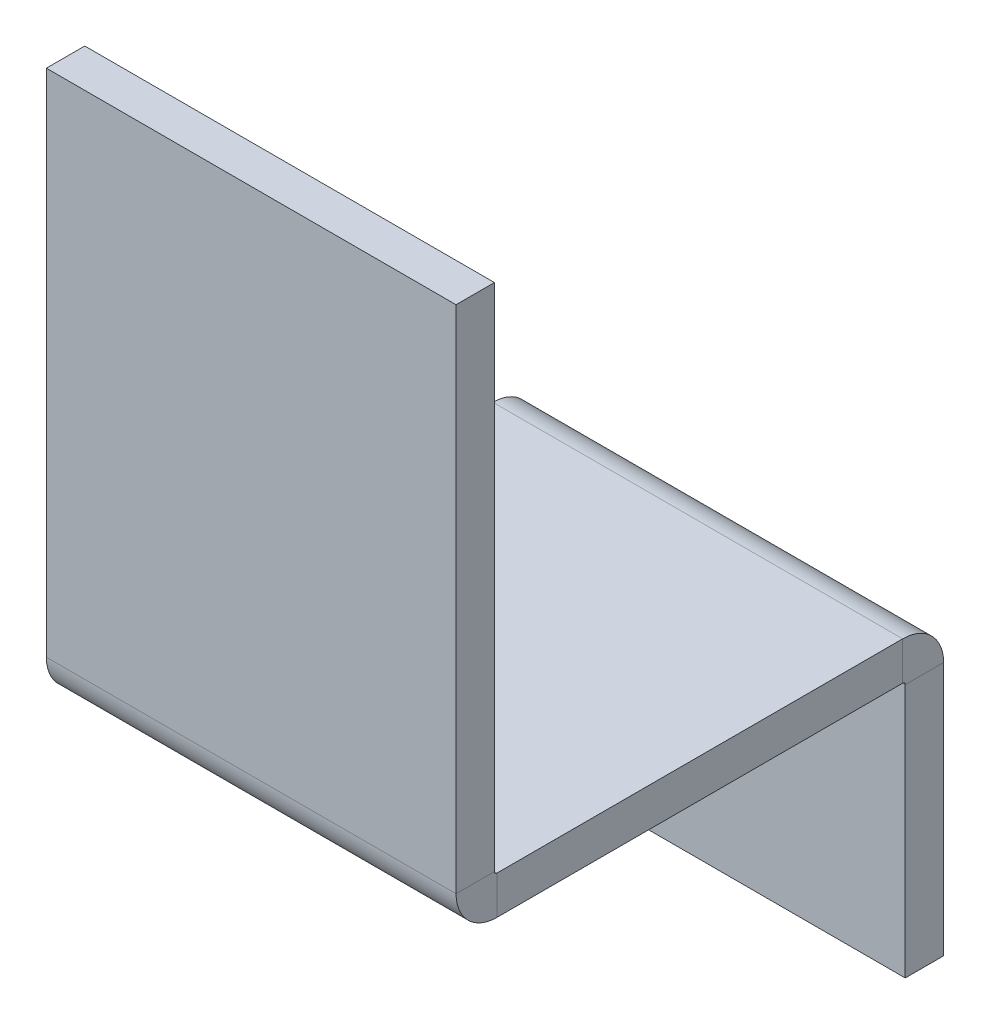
ISO-10303-21;
HEADER;
FILE_DESCRIPTION(('STEP AP214'),'2;1');
FILE_NAME('part.step','',(''),(''),'','','');
FILE_SCHEMA(('AUTOMOTIVE_DESIGN { 1 0 10303 214 1 1 1 1 }'));
ENDSEC;
DATA;
#1=APPLICATION_CONTEXT('core data for automotive mechanical design processes');
#2=APPLICATION_PROTOCOL_DEFINITION('international standard','automotive_design',2000,#1);
#3=PRODUCT_CONTEXT('',#1,'mechanical');
#4=PRODUCT('Part','Part','',(#3));
#5=PRODUCT_RELATED_PRODUCT_CATEGORY('part','',(#4));
#6=PRODUCT_DEFINITION_FORMATION('','',#4);
#7=PRODUCT_DEFINITION_CONTEXT('part definition',#1,'design');
#8=PRODUCT_DEFINITION('design','',#6,#7);
#9=PRODUCT_DEFINITION_SHAPE('','',#8);
#10=(LENGTH_UNIT() NAMED_UNIT(*) SI_UNIT(.MILLI.,.METRE.));
#11=(NAMED_UNIT(*) PLANE_ANGLE_UNIT() SI_UNIT($,.RADIAN.));
#12=(NAMED_UNIT(*) SI_UNIT($,.STERADIAN.) SOLID_ANGLE_UNIT());
#13=UNCERTAINTY_MEASURE_WITH_UNIT(LENGTH_MEASURE(1.E-05),#10,'distance_accuracy_value','');
#14=(GEOMETRIC_REPRESENTATION_CONTEXT(3) GLOBAL_UNCERTAINTY_ASSIGNED_CONTEXT((#13)) GLOBAL_UNIT_ASSIGNED_CONTEXT((#10,
#11,#12)) REPRESENTATION_CONTEXT('',''));
#15=CARTESIAN_POINT('',(0.,0.,0.));
#16=DIRECTION('',(0.,0.,1.));
#17=DIRECTION('',(1.,0.,0.));
#18=AXIS2_PLACEMENT_3D('',#15,#16,#17);
#19=CARTESIAN_POINT('',(0.,1.5,0.));
#20=DIRECTION('',(1.,0.,0.));
#21=DIRECTION('',(0.,0.,-1.));
#22=AXIS2_PLACEMENT_3D('',#19,#20,#21);
#23=PLANE('',#22);
#24=DIRECTION('',(0.,0.,1.));
#25=VECTOR('',#24,1.);
#26=CARTESIAN_POINT('',(0.,1.5,0.));
#27=LINE('',#26,#25);
#28=CARTESIAN_POINT('',(0.,1.5,-35.9214484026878));
#29=VERTEX_POINT('',#28);
#30=CARTESIAN_POINT('',(0.,1.5,-20.0785515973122));
#31=VERTEX_POINT('',#30);
#32=EDGE_CURVE('E206',#29,#31,#27,.T.);
#33=ORIENTED_EDGE('',*,*,#32,.F.);
#34=DIRECTION('',(0.,-1.,0.));
#35=VECTOR('',#34,1.);
#36=CARTESIAN_POINT('',(0.,1.5,-35.9214484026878));
#37=LINE('',#36,#35);
#38=CARTESIAN_POINT('',(0.,0.,-35.9214484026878));
#39=VERTEX_POINT('',#38);
#40=EDGE_CURVE('E12',#29,#39,#37,.T.);
#41=ORIENTED_EDGE('',*,*,#40,.T.);
#42=DIRECTION('',(0.,0.,1.));
#43=VECTOR('',#42,1.);
#44=CARTESIAN_POINT('',(0.,0.,0.));
#45=LINE('',#44,#43);
#46=CARTESIAN_POINT('',(0.,0.,-20.0785515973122));
#47=VERTEX_POINT('',#46);
#48=EDGE_CURVE('E198',#39,#47,#45,.T.);
#49=ORIENTED_EDGE('',*,*,#48,.T.);
#50=DIRECTION('',(0.,1.,0.));
#51=VECTOR('',#50,1.);
#52=CARTESIAN_POINT('',(0.,1.5,-20.0785515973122));
#53=LINE('',#52,#51);
#54=EDGE_CURVE('E195',#47,#31,#53,.T.);
#55=ORIENTED_EDGE('',*,*,#54,.T.);
#56=EDGE_LOOP('',(#33,#41,#49,#55));
#57=FACE_BOUND('',#56,.T.);
#58=ADVANCED_FACE('F40',(#57),#23,.F.);
#59=CARTESIAN_POINT('',(16.,1.5,0.));
#60=DIRECTION('',(-1.,0.,0.));
#61=DIRECTION('',(0.,0.,1.));
#62=AXIS2_PLACEMENT_3D('',#59,#60,#61);
#63=PLANE('',#62);
#64=DIRECTION('',(0.,0.,-1.));
#65=VECTOR('',#64,1.);
#66=CARTESIAN_POINT('',(16.,0.,0.));
#67=LINE('',#66,#65);
#68=CARTESIAN_POINT('',(16.,0.,-20.0785515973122));
#69=VERTEX_POINT('',#68);
#70=CARTESIAN_POINT('',(16.,0.,-35.9214484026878));
#71=VERTEX_POINT('',#70);
#72=EDGE_CURVE('E202',#69,#71,#67,.T.);
#73=ORIENTED_EDGE('',*,*,#72,.T.);
#74=DIRECTION('',(0.,1.,0.));
#75=VECTOR('',#74,1.);
#76=CARTESIAN_POINT('',(16.,1.5,-35.9214484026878));
#77=LINE('',#76,#75);
#78=CARTESIAN_POINT('',(16.,1.5,-35.9214484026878));
#79=VERTEX_POINT('',#78);
#80=EDGE_CURVE('E240',#71,#79,#77,.T.);
#81=ORIENTED_EDGE('',*,*,#80,.T.);
#82=DIRECTION('',(0.,0.,-1.));
#83=VECTOR('',#82,1.);
#84=CARTESIAN_POINT('',(16.,1.5,0.));
#85=LINE('',#84,#83);
#86=CARTESIAN_POINT('',(16.,1.5,-20.0785515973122));
#87=VERTEX_POINT('',#86);
#88=EDGE_CURVE('E43',#87,#79,#85,.T.);
#89=ORIENTED_EDGE('',*,*,#88,.F.);
#90=DIRECTION('',(0.,-1.,0.));
#91=VECTOR('',#90,1.);
#92=CARTESIAN_POINT('',(16.,1.5,-20.0785515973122));
#93=LINE('',#92,#91);
#94=EDGE_CURVE('E199',#87,#69,#93,.T.);
#95=ORIENTED_EDGE('',*,*,#94,.T.);
#96=EDGE_LOOP('',(#73,#81,#89,#95));
#97=FACE_BOUND('',#96,.T.);
#98=ADVANCED_FACE('F299',(#97),#63,.F.);
#99=CARTESIAN_POINT('',(0.,1.5,-46.));
#100=DIRECTION('',(0.,-1.,0.));
#101=DIRECTION('',(0.,0.,-1.));
#102=AXIS2_PLACEMENT_3D('',#99,#100,#101);
#103=PLANE('',#102);
#104=ORIENTED_EDGE('',*,*,#88,.T.);
#105=DIRECTION('',(-1.,0.,0.));
#106=VECTOR('',#105,1.);
#107=CARTESIAN_POINT('',(0.,1.5,-35.9214484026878));
#108=LINE('',#107,#106);
#109=EDGE_CURVE('E232',#79,#29,#108,.T.);
#110=ORIENTED_EDGE('',*,*,#109,.T.);
#111=ORIENTED_EDGE('',*,*,#32,.T.);
#112=DIRECTION('',(1.,0.,0.));
#113=VECTOR('',#112,1.);
#114=CARTESIAN_POINT('',(0.,1.5,-20.0785515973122));
#115=LINE('',#114,#113);
#116=EDGE_CURVE('E203',#31,#87,#115,.T.);
#117=ORIENTED_EDGE('',*,*,#116,.T.);
#118=EDGE_LOOP('',(#104,#110,#111,#117));
#119=FACE_BOUND('',#118,.T.);
#120=ADVANCED_FACE('F250',(#119),#103,.F.);
#121=CARTESIAN_POINT('',(0.,-24.4785515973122,-18.4785515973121));
#122=DIRECTION('',(0.,0.,1.));
#123=DIRECTION('',(0.,-1.,0.));
#124=AXIS2_PLACEMENT_3D('',#121,#122,#123);
#125=PLANE('',#124);
#126=DIRECTION('',(0.,1.,0.));
#127=VECTOR('',#126,1.);
#128=CARTESIAN_POINT('',(0.,21.5214484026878,-18.4785515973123));
#129=LINE('',#128,#127);
#130=CARTESIAN_POINT('',(0.,1.60000000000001,-18.4785515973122));
#131=VERTEX_POINT('',#130);
#132=CARTESIAN_POINT('',(0.,21.5214484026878,-18.4785515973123));
#133=VERTEX_POINT('',#132);
#134=EDGE_CURVE('E63',#131,#133,#129,.T.);
#135=ORIENTED_EDGE('',*,*,#134,.F.);
#136=DIRECTION('',(1.,0.,0.));
#137=VECTOR('',#136,1.);
#138=CARTESIAN_POINT('',(0.,1.60000000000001,-18.4785515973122));
#139=LINE('',#138,#137);
#140=CARTESIAN_POINT('',(16.,1.60000000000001,-18.4785515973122));
#141=VERTEX_POINT('',#140);
#142=EDGE_CURVE('E227',#131,#141,#139,.T.);
#143=ORIENTED_EDGE('',*,*,#142,.T.);
#144=DIRECTION('',(0.,-1.,0.));
#145=VECTOR('',#144,1.);
#146=CARTESIAN_POINT('',(16.,21.5214484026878,-18.4785515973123));
#147=LINE('',#146,#145);
#148=CARTESIAN_POINT('',(16.,21.5214484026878,-18.4785515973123));
#149=VERTEX_POINT('',#148);
#150=EDGE_CURVE('E214',#149,#141,#147,.T.);
#151=ORIENTED_EDGE('',*,*,#150,.F.);
#152=DIRECTION('',(1.,0.,0.));
#153=VECTOR('',#152,1.);
#154=CARTESIAN_POINT('',(0.,21.5214484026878,-18.4785515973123));
#155=LINE('',#154,#153);
#156=EDGE_CURVE('E212',#133,#149,#155,.T.);
#157=ORIENTED_EDGE('',*,*,#156,.F.);
#158=EDGE_LOOP('',(#135,#143,#151,#157));
#159=FACE_BOUND('',#158,.T.);
#160=ADVANCED_FACE('F285',(#159),#125,.T.);
#161=CARTESIAN_POINT('',(0.,-24.4785515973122,-19.9785515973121));
#162=DIRECTION('',(0.,0.,1.));
#163=DIRECTION('',(0.,-1.,0.));
#164=AXIS2_PLACEMENT_3D('',#161,#162,#163);
#165=PLANE('',#164);
#166=DIRECTION('',(1.,0.,0.));
#167=VECTOR('',#166,1.);
#168=CARTESIAN_POINT('',(0.,1.6,-19.9785515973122));
#169=LINE('',#168,#167);
#170=CARTESIAN_POINT('',(0.,1.6,-19.9785515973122));
#171=VERTEX_POINT('',#170);
#172=CARTESIAN_POINT('',(16.,1.6,-19.9785515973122));
#173=VERTEX_POINT('',#172);
#174=EDGE_CURVE('E221',#171,#173,#169,.T.);
#175=ORIENTED_EDGE('',*,*,#174,.F.);
#176=DIRECTION('',(0.,1.,0.));
#177=VECTOR('',#176,1.);
#178=CARTESIAN_POINT('',(0.,21.5214484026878,-19.9785515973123));
#179=LINE('',#178,#177);
#180=CARTESIAN_POINT('',(0.,21.5214484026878,-19.9785515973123));
#181=VERTEX_POINT('',#180);
#182=EDGE_CURVE('E211',#171,#181,#179,.T.);
#183=ORIENTED_EDGE('',*,*,#182,.T.);
#184=DIRECTION('',(1.,0.,0.));
#185=VECTOR('',#184,1.);
#186=CARTESIAN_POINT('',(0.,21.5214484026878,-19.9785515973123));
#187=LINE('',#186,#185);
#188=CARTESIAN_POINT('',(16.,21.5214484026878,-19.9785515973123));
#189=VERTEX_POINT('',#188);
#190=EDGE_CURVE('E208',#181,#189,#187,.T.);
#191=ORIENTED_EDGE('',*,*,#190,.T.);
#192=DIRECTION('',(0.,-1.,0.));
#193=VECTOR('',#192,1.);
#194=CARTESIAN_POINT('',(16.,21.5214484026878,-19.9785515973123));
#195=LINE('',#194,#193);
#196=EDGE_CURVE('E210',#189,#173,#195,.T.);
#197=ORIENTED_EDGE('',*,*,#196,.T.);
#198=EDGE_LOOP('',(#175,#183,#191,#197));
#199=FACE_BOUND('',#198,.T.);
#200=ADVANCED_FACE('F278',(#199),#165,.F.);
#201=CARTESIAN_POINT('',(0.,21.5214484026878,-19.9785515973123));
#202=DIRECTION('',(1.,0.,0.));
#203=DIRECTION('',(0.,-1.,0.));
#204=AXIS2_PLACEMENT_3D('',#201,#202,#203);
#205=PLANE('',#204);
#206=DIRECTION('',(0.,0.,-1.));
#207=VECTOR('',#206,1.);
#208=CARTESIAN_POINT('',(0.,1.6,-19.9785515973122));
#209=LINE('',#208,#207);
#210=EDGE_CURVE('E229',#131,#171,#209,.T.);
#211=ORIENTED_EDGE('',*,*,#210,.F.);
#212=ORIENTED_EDGE('',*,*,#134,.T.);
#213=DIRECTION('',(0.,0.,1.));
#214=VECTOR('',#213,1.);
#215=CARTESIAN_POINT('',(0.,21.5214484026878,-19.9785515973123));
#216=LINE('',#215,#214);
#217=EDGE_CURVE('E218',#181,#133,#216,.T.);
#218=ORIENTED_EDGE('',*,*,#217,.F.);
#219=ORIENTED_EDGE('',*,*,#182,.F.);
#220=EDGE_LOOP('',(#211,#212,#218,#219));
#221=FACE_BOUND('',#220,.T.);
#222=ADVANCED_FACE('F287',(#221),#205,.F.);
#223=CARTESIAN_POINT('',(0.,21.5214484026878,-19.9785515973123));
#224=DIRECTION('',(0.,-1.,0.));
#225=DIRECTION('',(-1.,0.,0.));
#226=AXIS2_PLACEMENT_3D('',#223,#224,#225);
#227=PLANE('',#226);
#228=ORIENTED_EDGE('',*,*,#156,.T.);
#229=DIRECTION('',(0.,0.,1.));
#230=VECTOR('',#229,1.);
#231=CARTESIAN_POINT('',(16.,21.5214484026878,-19.9785515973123));
#232=LINE('',#231,#230);
#233=EDGE_CURVE('E215',#189,#149,#232,.T.);
#234=ORIENTED_EDGE('',*,*,#233,.F.);
#235=ORIENTED_EDGE('',*,*,#190,.F.);
#236=ORIENTED_EDGE('',*,*,#217,.T.);
#237=EDGE_LOOP('',(#228,#234,#235,#236));
#238=FACE_BOUND('',#237,.T.);
#239=ADVANCED_FACE('F284',(#238),#227,.F.);
#240=CARTESIAN_POINT('',(16.,21.5214484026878,-19.9785515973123));
#241=DIRECTION('',(-1.,0.,0.));
#242=DIRECTION('',(0.,1.,0.));
#243=AXIS2_PLACEMENT_3D('',#240,#241,#242);
#244=PLANE('',#243);
#245=DIRECTION('',(0.,0.,1.));
#246=VECTOR('',#245,1.);
#247=CARTESIAN_POINT('',(16.,1.6,-19.9785515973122));
#248=LINE('',#247,#246);
#249=EDGE_CURVE('E224',#173,#141,#248,.T.);
#250=ORIENTED_EDGE('',*,*,#249,.F.);
#251=ORIENTED_EDGE('',*,*,#196,.F.);
#252=ORIENTED_EDGE('',*,*,#233,.T.);
#253=ORIENTED_EDGE('',*,*,#150,.T.);
#254=EDGE_LOOP('',(#250,#251,#252,#253));
#255=FACE_BOUND('',#254,.T.);
#256=ADVANCED_FACE('F275',(#255),#244,.F.);
#257=CARTESIAN_POINT('',(0.,0.,-46.));
#258=DIRECTION('',(0.,-1.,0.));
#259=DIRECTION('',(0.,0.,-1.));
#260=AXIS2_PLACEMENT_3D('',#257,#258,#259);
#261=PLANE('',#260);
#262=DIRECTION('',(-1.,0.,0.));
#263=VECTOR('',#262,1.);
#264=CARTESIAN_POINT('',(0.,0.,-35.9214484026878));
#265=LINE('',#264,#263);
#266=EDGE_CURVE('E48',#71,#39,#265,.T.);
#267=ORIENTED_EDGE('',*,*,#266,.F.);
#268=ORIENTED_EDGE('',*,*,#72,.F.);
#269=DIRECTION('',(1.,0.,0.));
#270=VECTOR('',#269,1.);
#271=CARTESIAN_POINT('',(0.,0.,-20.0785515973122));
#272=LINE('',#271,#270);
#273=EDGE_CURVE('E190',#47,#69,#272,.T.);
#274=ORIENTED_EDGE('',*,*,#273,.F.);
#275=ORIENTED_EDGE('',*,*,#48,.F.);
#276=EDGE_LOOP('',(#267,#268,#274,#275));
#277=FACE_BOUND('',#276,.T.);
#278=ADVANCED_FACE('F265',(#277),#261,.T.);
#279=CARTESIAN_POINT('',(0.,1.6,-20.0785515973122));
#280=DIRECTION('',(1.,0.,0.));
#281=DIRECTION('',(0.,0.,-1.));
#282=AXIS2_PLACEMENT_3D('',#279,#280,#281);
#283=PLANE('',#282);
#284=ORIENTED_EDGE('',*,*,#54,.F.);
#285=CARTESIAN_POINT('',(0.,1.6,-20.0785515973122));
#286=DIRECTION('',(1.,0.,0.));
#287=DIRECTION('',(0.,0.,-1.));
#288=AXIS2_PLACEMENT_3D('',#285,#286,#287);
#289=CIRCLE('',#288,1.6);
#290=EDGE_CURVE('E178',#47,#131,#289,.F.);
#291=ORIENTED_EDGE('',*,*,#290,.T.);
#292=ORIENTED_EDGE('',*,*,#210,.T.);
#293=CARTESIAN_POINT('',(0.,1.6,-20.0785515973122));
#294=DIRECTION('',(-1.,0.,0.));
#295=DIRECTION('',(0.,0.,1.));
#296=AXIS2_PLACEMENT_3D('',#293,#294,#295);
#297=CIRCLE('',#296,0.0999999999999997);
#298=EDGE_CURVE('E183',#31,#171,#297,.T.);
#299=ORIENTED_EDGE('',*,*,#298,.F.);
#300=EDGE_LOOP('',(#284,#291,#292,#299));
#301=FACE_BOUND('',#300,.T.);
#302=ADVANCED_FACE('F257',(#301),#283,.F.);
#303=CARTESIAN_POINT('',(16.,1.6,-20.0785515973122));
#304=DIRECTION('',(-1.,0.,0.));
#305=DIRECTION('',(0.,0.,1.));
#306=AXIS2_PLACEMENT_3D('',#303,#304,#305);
#307=PLANE('',#306);
#308=ORIENTED_EDGE('',*,*,#249,.T.);
#309=CARTESIAN_POINT('',(16.,1.6,-20.0785515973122));
#310=DIRECTION('',(1.,0.,0.));
#311=DIRECTION('',(0.,0.,-1.));
#312=AXIS2_PLACEMENT_3D('',#309,#310,#311);
#313=CIRCLE('',#312,1.6);
#314=EDGE_CURVE('E187',#141,#69,#313,.T.);
#315=ORIENTED_EDGE('',*,*,#314,.T.);
#316=ORIENTED_EDGE('',*,*,#94,.F.);
#317=CARTESIAN_POINT('',(16.,1.6,-20.0785515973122));
#318=DIRECTION('',(1.,0.,0.));
#319=DIRECTION('',(0.,0.,-1.));
#320=AXIS2_PLACEMENT_3D('',#317,#318,#319);
#321=CIRCLE('',#320,0.0999999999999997);
#322=EDGE_CURVE('E186',#173,#87,#321,.T.);
#323=ORIENTED_EDGE('',*,*,#322,.F.);
#324=EDGE_LOOP('',(#308,#315,#316,#323));
#325=FACE_BOUND('',#324,.T.);
#326=ADVANCED_FACE('F272',(#325),#307,.F.);
#327=CARTESIAN_POINT('',(-8.07092658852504,1.6,-20.0785515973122));
#328=DIRECTION('',(1.,0.,0.));
#329=DIRECTION('',(0.,0.,-1.));
#330=AXIS2_PLACEMENT_3D('',#327,#328,#329);
#331=CYLINDRICAL_SURFACE('',#330,0.1);
#332=ORIENTED_EDGE('',*,*,#322,.T.);
#333=ORIENTED_EDGE('',*,*,#116,.F.);
#334=ORIENTED_EDGE('',*,*,#298,.T.);
#335=ORIENTED_EDGE('',*,*,#174,.T.);
#336=EDGE_LOOP('',(#332,#333,#334,#335));
#337=FACE_BOUND('',#336,.T.);
#338=ADVANCED_FACE('F260',(#337),#331,.F.);
#339=CARTESIAN_POINT('',(-8.07092658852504,1.6,-20.0785515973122));
#340=DIRECTION('',(1.,0.,0.));
#341=DIRECTION('',(0.,0.,-1.));
#342=AXIS2_PLACEMENT_3D('',#339,#340,#341);
#343=CYLINDRICAL_SURFACE('',#342,1.6);
#344=ORIENTED_EDGE('',*,*,#314,.F.);
#345=ORIENTED_EDGE('',*,*,#142,.F.);
#346=ORIENTED_EDGE('',*,*,#290,.F.);
#347=ORIENTED_EDGE('',*,*,#273,.T.);
#348=EDGE_LOOP('',(#344,#345,#346,#347));
#349=FACE_BOUND('',#348,.T.);
#350=ADVANCED_FACE('F269',(#349),#343,.T.);
#351=CARTESIAN_POINT('',(16.,-0.1,-35.9214484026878));
#352=DIRECTION('',(1.,0.,0.));
#353=DIRECTION('',(0.,0.,-1.));
#354=AXIS2_PLACEMENT_3D('',#351,#352,#353);
#355=PLANE('',#354);
#356=ORIENTED_EDGE('',*,*,#80,.F.);
#357=CARTESIAN_POINT('',(16.,-0.1,-35.9214484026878));
#358=DIRECTION('',(-1.,0.,0.));
#359=DIRECTION('',(0.,0.,1.));
#360=AXIS2_PLACEMENT_3D('',#357,#358,#359);
#361=CIRCLE('',#360,0.1);
#362=CARTESIAN_POINT('',(16.,-0.0999999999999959,-36.0214484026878));
#363=VERTEX_POINT('',#362);
#364=EDGE_CURVE('E180',#71,#363,#361,.T.);
#365=ORIENTED_EDGE('',*,*,#364,.T.);
#366=DIRECTION('',(0.,0.,-1.));
#367=VECTOR('',#366,1.);
#368=CARTESIAN_POINT('',(16.,-0.100000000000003,-37.5214484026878));
#369=LINE('',#368,#367);
#370=CARTESIAN_POINT('',(16.,-0.100000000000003,-37.5214484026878));
#371=VERTEX_POINT('',#370);
#372=EDGE_CURVE('E139',#363,#371,#369,.T.);
#373=ORIENTED_EDGE('',*,*,#372,.T.);
#374=CARTESIAN_POINT('',(16.,-0.1,-35.9214484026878));
#375=DIRECTION('',(-1.,0.,0.));
#376=DIRECTION('',(0.,0.,1.));
#377=AXIS2_PLACEMENT_3D('',#374,#375,#376);
#378=CIRCLE('',#377,1.6);
#379=EDGE_CURVE('E171',#79,#371,#378,.T.);
#380=ORIENTED_EDGE('',*,*,#379,.F.);
#381=EDGE_LOOP('',(#356,#365,#373,#380));
#382=FACE_BOUND('',#381,.T.);
#383=ADVANCED_FACE('F378',(#382),#355,.T.);
#384=CARTESIAN_POINT('',(0.,-0.1,-35.9214484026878));
#385=DIRECTION('',(-1.,0.,0.));
#386=DIRECTION('',(0.,0.,1.));
#387=AXIS2_PLACEMENT_3D('',#384,#385,#386);
#388=PLANE('',#387);
#389=DIRECTION('',(0.,0.,1.));
#390=VECTOR('',#389,1.);
#391=CARTESIAN_POINT('',(0.,-0.100000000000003,-37.5214484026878));
#392=LINE('',#391,#390);
#393=CARTESIAN_POINT('',(0.,-0.100000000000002,-37.5214484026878));
#394=VERTEX_POINT('',#393);
#395=CARTESIAN_POINT('',(0.,-0.0999999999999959,-36.0214484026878));
#396=VERTEX_POINT('',#395);
#397=EDGE_CURVE('E165',#394,#396,#392,.T.);
#398=ORIENTED_EDGE('',*,*,#397,.T.);
#399=CARTESIAN_POINT('',(0.,-0.1,-35.9214484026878));
#400=DIRECTION('',(-1.,0.,0.));
#401=DIRECTION('',(0.,0.,1.));
#402=AXIS2_PLACEMENT_3D('',#399,#400,#401);
#403=CIRCLE('',#402,0.1);
#404=EDGE_CURVE('E175',#396,#39,#403,.F.);
#405=ORIENTED_EDGE('',*,*,#404,.T.);
#406=ORIENTED_EDGE('',*,*,#40,.F.);
#407=CARTESIAN_POINT('',(0.,-0.1,-35.9214484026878));
#408=DIRECTION('',(1.,0.,0.));
#409=DIRECTION('',(0.,0.,-1.));
#410=AXIS2_PLACEMENT_3D('',#407,#408,#409);
#411=CIRCLE('',#410,1.6);
#412=EDGE_CURVE('E174',#394,#29,#411,.T.);
#413=ORIENTED_EDGE('',*,*,#412,.F.);
#414=EDGE_LOOP('',(#398,#405,#406,#413));
#415=FACE_BOUND('',#414,.T.);
#416=ADVANCED_FACE('F410',(#415),#388,.T.);
#417=CARTESIAN_POINT('',(24.070926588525,-0.1,-35.9214484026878));
#418=DIRECTION('',(-1.,0.,0.));
#419=DIRECTION('',(0.,0.,1.));
#420=AXIS2_PLACEMENT_3D('',#417,#418,#419);
#421=CYLINDRICAL_SURFACE('',#420,1.6);
#422=ORIENTED_EDGE('',*,*,#412,.T.);
#423=ORIENTED_EDGE('',*,*,#109,.F.);
#424=ORIENTED_EDGE('',*,*,#379,.T.);
#425=DIRECTION('',(-1.,0.,0.));
#426=VECTOR('',#425,1.);
#427=CARTESIAN_POINT('',(0.,-0.100000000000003,-37.5214484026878));
#428=LINE('',#427,#426);
#429=EDGE_CURVE('E168',#371,#394,#428,.T.);
#430=ORIENTED_EDGE('',*,*,#429,.T.);
#431=EDGE_LOOP('',(#422,#423,#424,#430));
#432=FACE_BOUND('',#431,.T.);
#433=ADVANCED_FACE('F421',(#432),#421,.T.);
#434=CARTESIAN_POINT('',(24.070926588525,-0.1,-35.9214484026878));
#435=DIRECTION('',(-1.,0.,0.));
#436=DIRECTION('',(0.,0.,1.));
#437=AXIS2_PLACEMENT_3D('',#434,#435,#436);
#438=CYLINDRICAL_SURFACE('',#437,0.1);
#439=ORIENTED_EDGE('',*,*,#404,.F.);
#440=DIRECTION('',(-1.,0.,0.));
#441=VECTOR('',#440,1.);
#442=CARTESIAN_POINT('',(0.,-0.0999999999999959,-36.0214484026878));
#443=LINE('',#442,#441);
#444=EDGE_CURVE('E514',#363,#396,#443,.T.);
#445=ORIENTED_EDGE('',*,*,#444,.F.);
#446=ORIENTED_EDGE('',*,*,#364,.F.);
#447=ORIENTED_EDGE('',*,*,#266,.T.);
#448=EDGE_LOOP('',(#439,#445,#446,#447));
#449=FACE_BOUND('',#448,.T.);
#450=ADVANCED_FACE('F432',(#449),#438,.F.);
#451=CARTESIAN_POINT('',(7.99999999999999,-5.02144840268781,-37.5214484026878));
#452=DIRECTION('',(0.,0.,1.));
#453=DIRECTION('',(0.,-1.,0.));
#454=AXIS2_PLACEMENT_3D('',#451,#452,#453);
#455=CYLINDRICAL_SURFACE('',#454,1.75);
#456=CARTESIAN_POINT('',(7.99999999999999,-5.02144840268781,-37.5214484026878));
#457=DIRECTION('',(0.,0.,-1.));
#458=DIRECTION('',(0.,1.,0.));
#459=AXIS2_PLACEMENT_3D('',#456,#457,#458);
#460=CIRCLE('',#459,1.75);
#461=CARTESIAN_POINT('',(7.99999999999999,-3.27144840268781,-37.5214484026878));
#462=VERTEX_POINT('',#461);
#463=EDGE_CURVE('E158',#462,#462,#460,.T.);
#464=ORIENTED_EDGE('',*,*,#463,.T.);
#465=EDGE_LOOP('',(#464));
#466=FACE_BOUND('',#465,.T.);
#467=CARTESIAN_POINT('',(7.99999999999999,-5.0214484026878,-36.0214484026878));
#468=DIRECTION('',(0.,0.,-1.));
#469=DIRECTION('',(0.,1.,0.));
#470=AXIS2_PLACEMENT_3D('',#467,#468,#469);
#471=CIRCLE('',#470,1.75);
#472=CARTESIAN_POINT('',(7.99999999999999,-3.2714484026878,-36.0214484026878));
#473=VERTEX_POINT('',#472);
#474=EDGE_CURVE('E144',#473,#473,#471,.T.);
#475=ORIENTED_EDGE('',*,*,#474,.F.);
#476=EDGE_LOOP('',(#475));
#477=FACE_BOUND('',#476,.T.);
#478=ADVANCED_FACE('F443',(#466,#477),#455,.F.);
#479=CARTESIAN_POINT('',(0.,-10.0214484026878,-37.5214484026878));
#480=DIRECTION('',(0.,1.,0.));
#481=DIRECTION('',(1.,0.,0.));
#482=AXIS2_PLACEMENT_3D('',#479,#480,#481);
#483=PLANE('',#482);
#484=DIRECTION('',(-1.,0.,0.));
#485=VECTOR('',#484,1.);
#486=CARTESIAN_POINT('',(0.,-10.0214484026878,-36.0214484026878));
#487=LINE('',#486,#485);
#488=CARTESIAN_POINT('',(16.,-10.0214484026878,-36.0214484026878));
#489=VERTEX_POINT('',#488);
#490=CARTESIAN_POINT('',(0.,-10.0214484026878,-36.0214484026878));
#491=VERTEX_POINT('',#490);
#492=EDGE_CURVE('E150',#489,#491,#487,.T.);
#493=ORIENTED_EDGE('',*,*,#492,.T.);
#494=DIRECTION('',(0.,0.,1.));
#495=VECTOR('',#494,1.);
#496=CARTESIAN_POINT('',(0.,-10.0214484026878,-37.5214484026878));
#497=LINE('',#496,#495);
#498=CARTESIAN_POINT('',(0.,-10.0214484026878,-37.5214484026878));
#499=VERTEX_POINT('',#498);
#500=EDGE_CURVE('E515',#499,#491,#497,.T.);
#501=ORIENTED_EDGE('',*,*,#500,.F.);
#502=DIRECTION('',(-1.,0.,0.));
#503=VECTOR('',#502,1.);
#504=CARTESIAN_POINT('',(0.,-10.0214484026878,-37.5214484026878));
#505=LINE('',#504,#503);
#506=CARTESIAN_POINT('',(16.,-10.0214484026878,-37.5214484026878));
#507=VERTEX_POINT('',#506);
#508=EDGE_CURVE('E152',#507,#499,#505,.T.);
#509=ORIENTED_EDGE('',*,*,#508,.F.);
#510=DIRECTION('',(0.,0.,1.));
#511=VECTOR('',#510,1.);
#512=CARTESIAN_POINT('',(16.,-10.0214484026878,-37.5214484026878));
#513=LINE('',#512,#511);
#514=EDGE_CURVE('E136',#507,#489,#513,.T.);
#515=ORIENTED_EDGE('',*,*,#514,.T.);
#516=EDGE_LOOP('',(#493,#501,#509,#515));
#517=FACE_BOUND('',#516,.T.);
#518=ADVANCED_FACE('F148',(#517),#483,.F.);
#519=CARTESIAN_POINT('',(0.,-10.0214484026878,-37.5214484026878));
#520=DIRECTION('',(0.,0.,1.));
#521=DIRECTION('',(0.,-1.,0.));
#522=AXIS2_PLACEMENT_3D('',#519,#520,#521);
#523=PLANE('',#522);
#524=ORIENTED_EDGE('',*,*,#429,.F.);
#525=DIRECTION('',(0.,-1.,0.));
#526=VECTOR('',#525,1.);
#527=CARTESIAN_POINT('',(16.,35.9785515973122,-37.5214484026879));
#528=LINE('',#527,#526);
#529=EDGE_CURVE('E153',#371,#507,#528,.T.);
#530=ORIENTED_EDGE('',*,*,#529,.T.);
#531=ORIENTED_EDGE('',*,*,#508,.T.);
#532=DIRECTION('',(0.,1.,0.));
#533=VECTOR('',#532,1.);
#534=CARTESIAN_POINT('',(0.,35.9785515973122,-37.5214484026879));
#535=LINE('',#534,#533);
#536=EDGE_CURVE('E145',#499,#394,#535,.T.);
#537=ORIENTED_EDGE('',*,*,#536,.T.);
#538=EDGE_LOOP('',(#524,#530,#531,#537));
#539=FACE_BOUND('',#538,.T.);
#540=ORIENTED_EDGE('',*,*,#463,.F.);
#541=EDGE_LOOP('',(#540));
#542=FACE_BOUND('',#541,.T.);
#543=ADVANCED_FACE('F463',(#539,#542),#523,.F.);
#544=CARTESIAN_POINT('',(16.,35.9785515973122,-37.5214484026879));
#545=DIRECTION('',(-1.,0.,0.));
#546=DIRECTION('',(0.,1.,0.));
#547=AXIS2_PLACEMENT_3D('',#544,#545,#546);
#548=PLANE('',#547);
#549=ORIENTED_EDGE('',*,*,#372,.F.);
#550=DIRECTION('',(0.,-1.,0.));
#551=VECTOR('',#550,1.);
#552=CARTESIAN_POINT('',(16.,35.9785515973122,-36.0214484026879));
#553=LINE('',#552,#551);
#554=EDGE_CURVE('E132',#363,#489,#553,.T.);
#555=ORIENTED_EDGE('',*,*,#554,.T.);
#556=ORIENTED_EDGE('',*,*,#514,.F.);
#557=ORIENTED_EDGE('',*,*,#529,.F.);
#558=EDGE_LOOP('',(#549,#555,#556,#557));
#559=FACE_BOUND('',#558,.T.);
#560=ADVANCED_FACE('F134',(#559),#548,.F.);
#561=CARTESIAN_POINT('',(0.,-10.0214484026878,-36.0214484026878));
#562=DIRECTION('',(0.,0.,1.));
#563=DIRECTION('',(0.,-1.,0.));
#564=AXIS2_PLACEMENT_3D('',#561,#562,#563);
#565=PLANE('',#564);
#566=ORIENTED_EDGE('',*,*,#474,.T.);
#567=EDGE_LOOP('',(#566));
#568=FACE_BOUND('',#567,.T.);
#569=ORIENTED_EDGE('',*,*,#554,.F.);
#570=ORIENTED_EDGE('',*,*,#444,.T.);
#571=DIRECTION('',(0.,1.,0.));
#572=VECTOR('',#571,1.);
#573=CARTESIAN_POINT('',(0.,35.9785515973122,-36.0214484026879));
#574=LINE('',#573,#572);
#575=EDGE_CURVE('E157',#491,#396,#574,.T.);
#576=ORIENTED_EDGE('',*,*,#575,.F.);
#577=ORIENTED_EDGE('',*,*,#492,.F.);
#578=EDGE_LOOP('',(#569,#570,#576,#577));
#579=FACE_BOUND('',#578,.T.);
#580=ADVANCED_FACE('F156',(#568,#579),#565,.T.);
#581=CARTESIAN_POINT('',(0.,35.9785515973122,-37.5214484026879));
#582=DIRECTION('',(1.,0.,0.));
#583=DIRECTION('',(0.,-1.,0.));
#584=AXIS2_PLACEMENT_3D('',#581,#582,#583);
#585=PLANE('',#584);
#586=ORIENTED_EDGE('',*,*,#397,.F.);
#587=ORIENTED_EDGE('',*,*,#536,.F.);
#588=ORIENTED_EDGE('',*,*,#500,.T.);
#589=ORIENTED_EDGE('',*,*,#575,.T.);
#590=EDGE_LOOP('',(#586,#587,#588,#589));
#591=FACE_BOUND('',#590,.T.);
#592=ADVANCED_FACE('F491',(#591),#585,.F.);
#593=CLOSED_SHELL('',(#58,#98,#120,#160,#200,#222,#239,#256,#278,#302,#326,#338,#350,#383,#416,
#433,#450,#478,#518,#543,#560,#580,#592));
#594=MANIFOLD_SOLID_BREP('B2',#593);
#595=ADVANCED_BREP_SHAPE_REPRESENTATION('',(#18,#594),#14);
#596=SHAPE_DEFINITION_REPRESENTATION(#9,#595);
ENDSEC;
END-ISO-10303-21;
